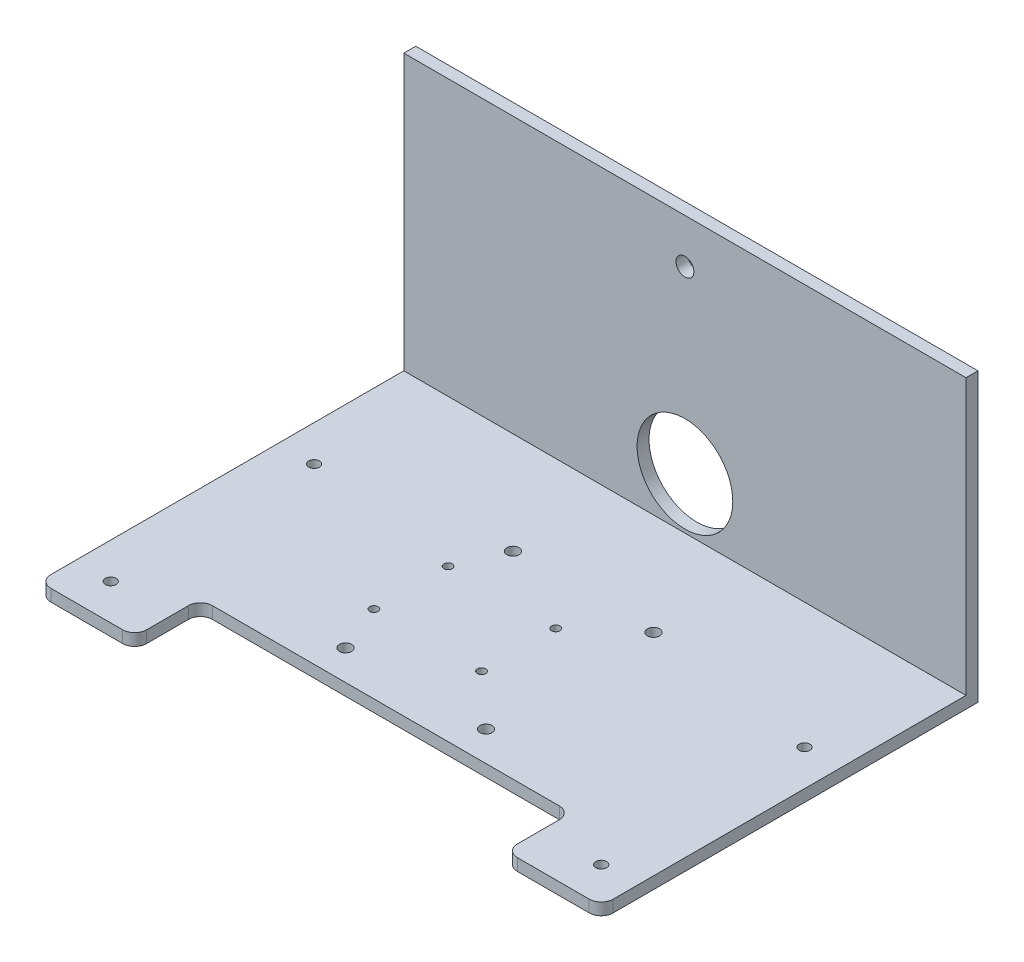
from build123d import *

# Parameters (mm, degrees)
ESQUISSE1_R             = 4.5
ESQUISSE1_R_2           = 3.5
BASE_EXTRUSION_DEPTH    = 10
ESQUISSE2_R             = 5.125
ENL_V_MAT_EXTRU_1_DEPTH = 394.128477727
ESQUISSE3_W             = 470
ESQUISSE3_H             = 10
BOSS_EXTRU_1_DEPTH      = 230
ESQUISSE4_R             = 7.5
ENL_V_MAT_EXTRU_2_DEPTH = 100
ESQUISSE5_R             = 40
ENL_V_MAT_EXTRU_3_DEPTH = 100


with BuildPart() as part:
    # Esquisse1 → Base-Extrusion (new body)
    with BuildSketch(Plane(origin=(0, 0, 0), x_dir=(1, 0, 0), z_dir=(0, 1, 0))):
        with BuildLine():
            Line((165, 0), (225, 0))
            ThreePointArc((225, 0), (232.071067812, 2.928932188), (235, 10))
            Line((235, 10), (235, 315))
            Line((235, 315), (-235, 315))
            Line((-235, 315), (-235, 10))
            ThreePointArc((-235, 10), (-232.071067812, 2.928932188), (-225, 0))
            Line((-225, 0), (-165, 0))
            ThreePointArc((-165, 0), (-157.928932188, 2.928932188), (-155, 10))
            Line((-155, 10), (-155, 45))
            ThreePointArc((-155, 45), (-152.071067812, 52.071067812), (-145, 55))
            Line((-145, 55), (145, 55))
            ThreePointArc((145, 55), (152.071067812, 52.071067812), (155, 45))
            Line((155, 45), (155, 10))
            ThreePointArc((155, 10), (157.928932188, 2.928932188), (165, 0))
        make_face()
        with Locations(Location((205, 200, 0), (0, 0, 270))):
            Circle(ESQUISSE1_R, mode=Mode.SUBTRACT)
        with Locations(Location((205, 30, 0), (0, 0, 270))):
            Circle(ESQUISSE1_R, mode=Mode.SUBTRACT)
        with Locations(Location((-205, 30, 0), (0, 0, 90))):
            Circle(ESQUISSE1_R, mode=Mode.SUBTRACT)
        with Locations(Location((-205, 200, 0), (0, 0, 90))):
            Circle(ESQUISSE1_R, mode=Mode.SUBTRACT)
        with Locations(Location((-75, 182, 0), (0, 0, 270))):
            Circle(ESQUISSE1_R_2, mode=Mode.SUBTRACT)
        with Locations(Location((-75, 120, 0), (0, 0, 270))):
            Circle(ESQUISSE1_R_2, mode=Mode.SUBTRACT)
        with Locations(Location((15, 182, 0), (0, 0, 270))):
            Circle(ESQUISSE1_R_2, mode=Mode.SUBTRACT)
        with Locations(Location((15, 120, 0), (0, 0, 270))):
            Circle(ESQUISSE1_R_2, mode=Mode.SUBTRACT)
    extrude(amount=BASE_EXTRUSION_DEPTH)

    # Esquisse2 → Enl_v. mat.-Extru.1 (cut, through all)
    with BuildSketch(Plane(origin=(0, 10, 0), x_dir=(-1, 0, 0), z_dir=(0, 1, 0))):
        with Locations(Location((58.75, -80, 0), (0, 0, 90))):
            Circle(ESQUISSE2_R)
        with Locations(Location((-58.75, -80, 0), (0, 0, 90))):
            Circle(ESQUISSE2_R)
        with Locations(Location((58.75, -220, 0), (0, 0, 90))):
            Circle(ESQUISSE2_R)
        with Locations(Location((-58.75, -220, 0), (0, 0, 90))):
            Circle(ESQUISSE2_R)
    extrude(amount=-ENL_V_MAT_EXTRU_1_DEPTH, mode=Mode.SUBTRACT)

    # Esquisse3 → Boss.-Extru.1 (add)
    with BuildSketch(Plane(origin=(0, 10, 0), x_dir=(1, 0, 0), z_dir=(0, 1, 0))):
        with Locations((0, 310)):
            Rectangle(ESQUISSE3_W, ESQUISSE3_H)
    extrude(amount=BOSS_EXTRU_1_DEPTH)

    # Esquisse4 → Enl_v. mat.-Extru.2 (cut)
    with BuildSketch(Plane.XY.offset(-305)):
        with Locations((0, 202.9)):
            Circle(ESQUISSE4_R)
    extrude(amount=-ENL_V_MAT_EXTRU_2_DEPTH, mode=Mode.SUBTRACT)

    # Esquisse5 → Enl_v. mat.-Extru.3 (cut)
    with BuildSketch(Plane.XY.offset(-305)):
        with Locations((0, 52.9)):
            Circle(ESQUISSE5_R)
    extrude(amount=-ENL_V_MAT_EXTRU_3_DEPTH, mode=Mode.SUBTRACT)


solid = part.part
